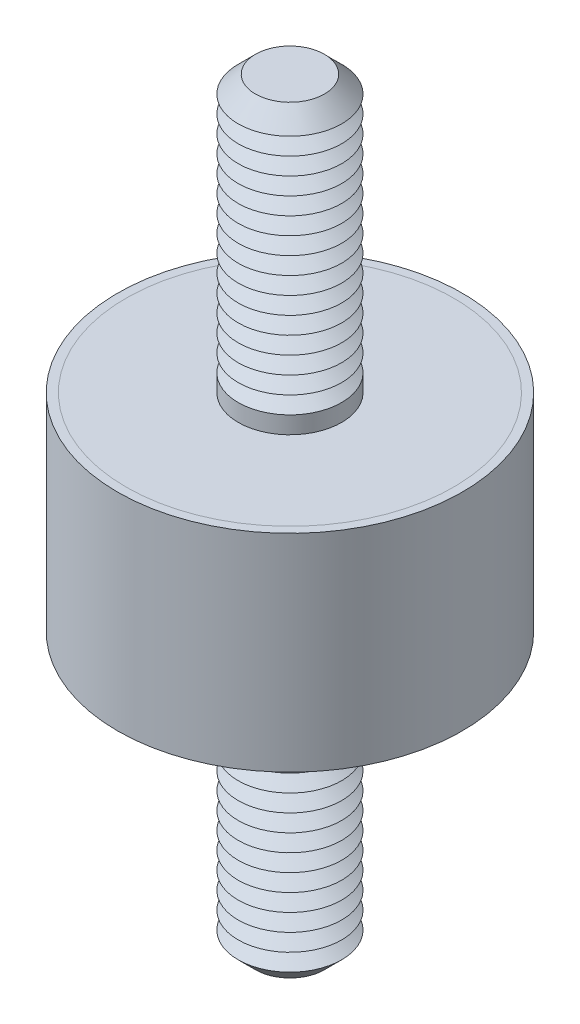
ISO-10303-21;
HEADER;
FILE_DESCRIPTION(('STEP AP214'),'2;1');
FILE_NAME('part.step','',(''),(''),'','','');
FILE_SCHEMA(('AUTOMOTIVE_DESIGN { 1 0 10303 214 1 1 1 1 }'));
ENDSEC;
DATA;
#1=APPLICATION_CONTEXT('core data for automotive mechanical design processes');
#2=APPLICATION_PROTOCOL_DEFINITION('international standard','automotive_design',2000,#1);
#3=PRODUCT_CONTEXT('',#1,'mechanical');
#4=PRODUCT('Part','Part','',(#3));
#5=PRODUCT_RELATED_PRODUCT_CATEGORY('part','',(#4));
#6=PRODUCT_DEFINITION_FORMATION('','',#4);
#7=PRODUCT_DEFINITION_CONTEXT('part definition',#1,'design');
#8=PRODUCT_DEFINITION('design','',#6,#7);
#9=PRODUCT_DEFINITION_SHAPE('','',#8);
#10=(LENGTH_UNIT() NAMED_UNIT(*) SI_UNIT(.MILLI.,.METRE.));
#11=(NAMED_UNIT(*) PLANE_ANGLE_UNIT() SI_UNIT($,.RADIAN.));
#12=(NAMED_UNIT(*) SI_UNIT($,.STERADIAN.) SOLID_ANGLE_UNIT());
#13=UNCERTAINTY_MEASURE_WITH_UNIT(LENGTH_MEASURE(1.E-05),#10,'distance_accuracy_value','');
#14=(GEOMETRIC_REPRESENTATION_CONTEXT(3) GLOBAL_UNCERTAINTY_ASSIGNED_CONTEXT((#13)) GLOBAL_UNIT_ASSIGNED_CONTEXT((#10,
#11,#12)) REPRESENTATION_CONTEXT('',''));
#15=CARTESIAN_POINT('',(0.,0.,0.));
#16=DIRECTION('',(0.,0.,1.));
#17=DIRECTION('',(1.,0.,0.));
#18=AXIS2_PLACEMENT_3D('',#15,#16,#17);
#19=CARTESIAN_POINT('',(0.,-22.,0.));
#20=DIRECTION('',(0.,1.,0.));
#21=DIRECTION('',(0.,0.,1.));
#22=AXIS2_PLACEMENT_3D('',#19,#20,#21);
#23=CYLINDRICAL_SURFACE('',#22,3.);
#24=CARTESIAN_POINT('',(0.,-6.,0.));
#25=DIRECTION('',(0.,-1.,0.));
#26=DIRECTION('',(0.,0.,-1.));
#27=AXIS2_PLACEMENT_3D('',#24,#25,#26);
#28=CIRCLE('',#27,3.);
#29=CARTESIAN_POINT('',(0.,-6.,-3.));
#30=VERTEX_POINT('',#29);
#31=EDGE_CURVE('P0_E21',#30,#30,#28,.T.);
#32=ORIENTED_EDGE('',*,*,#31,.T.);
#33=EDGE_LOOP('',(#32));
#34=FACE_BOUND('',#33,.T.);
#35=CARTESIAN_POINT('',(0.,-7.,0.));
#36=DIRECTION('',(0.,1.,0.));
#37=DIRECTION('',(0.,0.,1.));
#38=AXIS2_PLACEMENT_3D('',#35,#36,#37);
#39=CIRCLE('',#38,3.);
#40=CARTESIAN_POINT('',(0.,-7.,3.));
#41=VERTEX_POINT('',#40);
#42=EDGE_CURVE('P0_E33',#41,#41,#39,.T.);
#43=ORIENTED_EDGE('',*,*,#42,.T.);
#44=EDGE_LOOP('',(#43));
#45=FACE_BOUND('',#44,.T.);
#46=ADVANCED_FACE('P0_F14',(#34,#45),#23,.T.);
#47=CARTESIAN_POINT('',(0.,-6.,0.));
#48=DIRECTION('',(0.,1.,0.));
#49=DIRECTION('',(0.,0.,1.));
#50=AXIS2_PLACEMENT_3D('',#47,#48,#49);
#51=CYLINDRICAL_SURFACE('',#50,9.5);
#52=CARTESIAN_POINT('',(0.,-6.,0.));
#53=DIRECTION('',(0.,1.,0.));
#54=DIRECTION('',(0.,0.,1.));
#55=AXIS2_PLACEMENT_3D('',#52,#53,#54);
#56=CIRCLE('',#55,9.5);
#57=CARTESIAN_POINT('',(0.,-6.,9.5));
#58=VERTEX_POINT('',#57);
#59=EDGE_CURVE('P0_E25',#58,#58,#56,.T.);
#60=ORIENTED_EDGE('',*,*,#59,.T.);
#61=EDGE_LOOP('',(#60));
#62=FACE_BOUND('',#61,.T.);
#63=CARTESIAN_POINT('',(0.,-5.5,0.));
#64=DIRECTION('',(0.,1.,0.));
#65=DIRECTION('',(0.,0.,1.));
#66=AXIS2_PLACEMENT_3D('',#63,#64,#65);
#67=CIRCLE('',#66,9.5);
#68=CARTESIAN_POINT('',(0.,-5.5,9.5));
#69=VERTEX_POINT('',#68);
#70=EDGE_CURVE('P0_E30',#69,#69,#67,.T.);
#71=ORIENTED_EDGE('',*,*,#70,.F.);
#72=EDGE_LOOP('',(#71));
#73=FACE_BOUND('',#72,.T.);
#74=ADVANCED_FACE('P0_F145',(#62,#73),#51,.T.);
#75=CARTESIAN_POINT('',(0.,-6.,0.));
#76=DIRECTION('',(0.,1.,0.));
#77=DIRECTION('',(0.,0.,1.));
#78=AXIS2_PLACEMENT_3D('',#75,#76,#77);
#79=PLANE('',#78);
#80=ORIENTED_EDGE('',*,*,#31,.F.);
#81=EDGE_LOOP('',(#80));
#82=FACE_BOUND('',#81,.T.);
#83=ORIENTED_EDGE('',*,*,#59,.F.);
#84=EDGE_LOOP('',(#83));
#85=FACE_BOUND('',#84,.T.);
#86=ADVANCED_FACE('P0_F150',(#82,#85),#79,.F.);
#87=CARTESIAN_POINT('',(0.,-5.5,0.));
#88=DIRECTION('',(0.,1.,0.));
#89=DIRECTION('',(0.,0.,1.));
#90=AXIS2_PLACEMENT_3D('',#87,#88,#89);
#91=PLANE('',#90);
#92=ORIENTED_EDGE('',*,*,#70,.T.);
#93=EDGE_LOOP('',(#92));
#94=FACE_BOUND('',#93,.T.);
#95=ADVANCED_FACE('P0_F156',(#94),#91,.T.);
#96=CARTESIAN_POINT('',(0.,-7.,0.));
#97=DIRECTION('',(0.,1.,0.));
#98=DIRECTION('',(0.,0.,1.));
#99=AXIS2_PLACEMENT_3D('',#96,#97,#98);
#100=CONICAL_SURFACE('',#99,3.,1.0471975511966);
#101=CARTESIAN_POINT('',(0.,-7.5,0.));
#102=DIRECTION('',(0.,1.,0.));
#103=DIRECTION('',(0.,0.,1.));
#104=AXIS2_PLACEMENT_3D('',#101,#102,#103);
#105=CIRCLE('',#104,2.13397459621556);
#106=CARTESIAN_POINT('',(0.,-7.5,2.13397459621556));
#107=VERTEX_POINT('',#106);
#108=EDGE_CURVE('P0_E39',#107,#107,#105,.T.);
#109=ORIENTED_EDGE('',*,*,#108,.T.);
#110=EDGE_LOOP('',(#109));
#111=FACE_BOUND('',#110,.T.);
#112=ORIENTED_EDGE('',*,*,#42,.F.);
#113=EDGE_LOOP('',(#112));
#114=FACE_BOUND('',#113,.T.);
#115=ADVANCED_FACE('P0_F159',(#111,#114),#100,.T.);
#116=CARTESIAN_POINT('',(0.,-7.5,0.));
#117=DIRECTION('',(0.,-1.,0.));
#118=DIRECTION('',(0.,0.,-1.));
#119=AXIS2_PLACEMENT_3D('',#116,#117,#118);
#120=CONICAL_SURFACE('',#119,2.13397459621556,1.0471975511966);
#121=CARTESIAN_POINT('',(0.,-8.,0.));
#122=DIRECTION('',(0.,1.,0.));
#123=DIRECTION('',(0.,0.,1.));
#124=AXIS2_PLACEMENT_3D('',#121,#122,#123);
#125=CIRCLE('',#124,3.);
#126=CARTESIAN_POINT('',(0.,-8.,3.));
#127=VERTEX_POINT('',#126);
#128=EDGE_CURVE('P0_E43',#127,#127,#125,.T.);
#129=ORIENTED_EDGE('',*,*,#128,.T.);
#130=EDGE_LOOP('',(#129));
#131=FACE_BOUND('',#130,.T.);
#132=ORIENTED_EDGE('',*,*,#108,.F.);
#133=EDGE_LOOP('',(#132));
#134=FACE_BOUND('',#133,.T.);
#135=ADVANCED_FACE('P0_F163',(#131,#134),#120,.T.);
#136=CARTESIAN_POINT('',(0.,-8.,0.));
#137=DIRECTION('',(0.,1.,0.));
#138=DIRECTION('',(0.,0.,1.));
#139=AXIS2_PLACEMENT_3D('',#136,#137,#138);
#140=CONICAL_SURFACE('',#139,3.,1.0471975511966);
#141=CARTESIAN_POINT('',(0.,-8.5,0.));
#142=DIRECTION('',(0.,1.,0.));
#143=DIRECTION('',(0.,0.,1.));
#144=AXIS2_PLACEMENT_3D('',#141,#142,#143);
#145=CIRCLE('',#144,2.13397459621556);
#146=CARTESIAN_POINT('',(0.,-8.5,2.13397459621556));
#147=VERTEX_POINT('',#146);
#148=EDGE_CURVE('P0_E47',#147,#147,#145,.T.);
#149=ORIENTED_EDGE('',*,*,#148,.T.);
#150=EDGE_LOOP('',(#149));
#151=FACE_BOUND('',#150,.T.);
#152=ORIENTED_EDGE('',*,*,#128,.F.);
#153=EDGE_LOOP('',(#152));
#154=FACE_BOUND('',#153,.T.);
#155=ADVANCED_FACE('P0_F167',(#151,#154),#140,.T.);
#156=CARTESIAN_POINT('',(0.,-8.5,0.));
#157=DIRECTION('',(0.,-1.,0.));
#158=DIRECTION('',(0.,0.,-1.));
#159=AXIS2_PLACEMENT_3D('',#156,#157,#158);
#160=CONICAL_SURFACE('',#159,2.13397459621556,1.0471975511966);
#161=CARTESIAN_POINT('',(0.,-9.,0.));
#162=DIRECTION('',(0.,1.,0.));
#163=DIRECTION('',(0.,0.,1.));
#164=AXIS2_PLACEMENT_3D('',#161,#162,#163);
#165=CIRCLE('',#164,3.);
#166=CARTESIAN_POINT('',(0.,-9.,3.));
#167=VERTEX_POINT('',#166);
#168=EDGE_CURVE('P0_E52',#167,#167,#165,.T.);
#169=ORIENTED_EDGE('',*,*,#168,.T.);
#170=EDGE_LOOP('',(#169));
#171=FACE_BOUND('',#170,.T.);
#172=ORIENTED_EDGE('',*,*,#148,.F.);
#173=EDGE_LOOP('',(#172));
#174=FACE_BOUND('',#173,.T.);
#175=ADVANCED_FACE('P0_F174',(#171,#174),#160,.T.);
#176=CARTESIAN_POINT('',(0.,-9.,0.));
#177=DIRECTION('',(0.,1.,0.));
#178=DIRECTION('',(0.,0.,1.));
#179=AXIS2_PLACEMENT_3D('',#176,#177,#178);
#180=CONICAL_SURFACE('',#179,3.,1.0471975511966);
#181=CARTESIAN_POINT('',(0.,-9.5,0.));
#182=DIRECTION('',(0.,1.,0.));
#183=DIRECTION('',(0.,0.,1.));
#184=AXIS2_PLACEMENT_3D('',#181,#182,#183);
#185=CIRCLE('',#184,2.13397459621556);
#186=CARTESIAN_POINT('',(0.,-9.5,2.13397459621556));
#187=VERTEX_POINT('',#186);
#188=EDGE_CURVE('P0_E55',#187,#187,#185,.T.);
#189=ORIENTED_EDGE('',*,*,#188,.T.);
#190=EDGE_LOOP('',(#189));
#191=FACE_BOUND('',#190,.T.);
#192=ORIENTED_EDGE('',*,*,#168,.F.);
#193=EDGE_LOOP('',(#192));
#194=FACE_BOUND('',#193,.T.);
#195=ADVANCED_FACE('P0_F178',(#191,#194),#180,.T.);
#196=CARTESIAN_POINT('',(0.,-9.5,0.));
#197=DIRECTION('',(0.,-1.,0.));
#198=DIRECTION('',(0.,0.,-1.));
#199=AXIS2_PLACEMENT_3D('',#196,#197,#198);
#200=CONICAL_SURFACE('',#199,2.13397459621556,1.0471975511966);
#201=CARTESIAN_POINT('',(0.,-10.,0.));
#202=DIRECTION('',(0.,1.,0.));
#203=DIRECTION('',(0.,0.,1.));
#204=AXIS2_PLACEMENT_3D('',#201,#202,#203);
#205=CIRCLE('',#204,3.);
#206=CARTESIAN_POINT('',(0.,-10.,3.));
#207=VERTEX_POINT('',#206);
#208=EDGE_CURVE('P0_E58',#207,#207,#205,.T.);
#209=ORIENTED_EDGE('',*,*,#208,.T.);
#210=EDGE_LOOP('',(#209));
#211=FACE_BOUND('',#210,.T.);
#212=ORIENTED_EDGE('',*,*,#188,.F.);
#213=EDGE_LOOP('',(#212));
#214=FACE_BOUND('',#213,.T.);
#215=ADVANCED_FACE('P0_F182',(#211,#214),#200,.T.);
#216=CARTESIAN_POINT('',(0.,-10.,0.));
#217=DIRECTION('',(0.,1.,0.));
#218=DIRECTION('',(0.,0.,1.));
#219=AXIS2_PLACEMENT_3D('',#216,#217,#218);
#220=CONICAL_SURFACE('',#219,3.,1.0471975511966);
#221=CARTESIAN_POINT('',(0.,-10.5,0.));
#222=DIRECTION('',(0.,1.,0.));
#223=DIRECTION('',(0.,0.,1.));
#224=AXIS2_PLACEMENT_3D('',#221,#222,#223);
#225=CIRCLE('',#224,2.13397459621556);
#226=CARTESIAN_POINT('',(0.,-10.5,2.13397459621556));
#227=VERTEX_POINT('',#226);
#228=EDGE_CURVE('P0_E61',#227,#227,#225,.T.);
#229=ORIENTED_EDGE('',*,*,#228,.T.);
#230=EDGE_LOOP('',(#229));
#231=FACE_BOUND('',#230,.T.);
#232=ORIENTED_EDGE('',*,*,#208,.F.);
#233=EDGE_LOOP('',(#232));
#234=FACE_BOUND('',#233,.T.);
#235=ADVANCED_FACE('P0_F186',(#231,#234),#220,.T.);
#236=CARTESIAN_POINT('',(0.,-10.5,0.));
#237=DIRECTION('',(0.,-1.,0.));
#238=DIRECTION('',(0.,0.,-1.));
#239=AXIS2_PLACEMENT_3D('',#236,#237,#238);
#240=CONICAL_SURFACE('',#239,2.13397459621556,1.0471975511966);
#241=CARTESIAN_POINT('',(0.,-11.,0.));
#242=DIRECTION('',(0.,1.,0.));
#243=DIRECTION('',(0.,0.,1.));
#244=AXIS2_PLACEMENT_3D('',#241,#242,#243);
#245=CIRCLE('',#244,3.);
#246=CARTESIAN_POINT('',(0.,-11.,3.));
#247=VERTEX_POINT('',#246);
#248=EDGE_CURVE('P0_E64',#247,#247,#245,.T.);
#249=ORIENTED_EDGE('',*,*,#248,.T.);
#250=EDGE_LOOP('',(#249));
#251=FACE_BOUND('',#250,.T.);
#252=ORIENTED_EDGE('',*,*,#228,.F.);
#253=EDGE_LOOP('',(#252));
#254=FACE_BOUND('',#253,.T.);
#255=ADVANCED_FACE('P0_F190',(#251,#254),#240,.T.);
#256=CARTESIAN_POINT('',(0.,-11.,0.));
#257=DIRECTION('',(0.,1.,0.));
#258=DIRECTION('',(0.,0.,1.));
#259=AXIS2_PLACEMENT_3D('',#256,#257,#258);
#260=CONICAL_SURFACE('',#259,3.,1.0471975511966);
#261=CARTESIAN_POINT('',(0.,-11.5,0.));
#262=DIRECTION('',(0.,1.,0.));
#263=DIRECTION('',(0.,0.,1.));
#264=AXIS2_PLACEMENT_3D('',#261,#262,#263);
#265=CIRCLE('',#264,2.13397459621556);
#266=CARTESIAN_POINT('',(0.,-11.5,2.13397459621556));
#267=VERTEX_POINT('',#266);
#268=EDGE_CURVE('P0_E67',#267,#267,#265,.T.);
#269=ORIENTED_EDGE('',*,*,#268,.T.);
#270=EDGE_LOOP('',(#269));
#271=FACE_BOUND('',#270,.T.);
#272=ORIENTED_EDGE('',*,*,#248,.F.);
#273=EDGE_LOOP('',(#272));
#274=FACE_BOUND('',#273,.T.);
#275=ADVANCED_FACE('P0_F194',(#271,#274),#260,.T.);
#276=CARTESIAN_POINT('',(0.,-11.5,0.));
#277=DIRECTION('',(0.,-1.,0.));
#278=DIRECTION('',(0.,0.,-1.));
#279=AXIS2_PLACEMENT_3D('',#276,#277,#278);
#280=CONICAL_SURFACE('',#279,2.13397459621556,1.0471975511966);
#281=CARTESIAN_POINT('',(0.,-12.,0.));
#282=DIRECTION('',(0.,1.,0.));
#283=DIRECTION('',(0.,0.,1.));
#284=AXIS2_PLACEMENT_3D('',#281,#282,#283);
#285=CIRCLE('',#284,3.);
#286=CARTESIAN_POINT('',(0.,-12.,3.));
#287=VERTEX_POINT('',#286);
#288=EDGE_CURVE('P0_E70',#287,#287,#285,.T.);
#289=ORIENTED_EDGE('',*,*,#288,.T.);
#290=EDGE_LOOP('',(#289));
#291=FACE_BOUND('',#290,.T.);
#292=ORIENTED_EDGE('',*,*,#268,.F.);
#293=EDGE_LOOP('',(#292));
#294=FACE_BOUND('',#293,.T.);
#295=ADVANCED_FACE('P0_F198',(#291,#294),#280,.T.);
#296=CARTESIAN_POINT('',(0.,-12.,0.));
#297=DIRECTION('',(0.,1.,0.));
#298=DIRECTION('',(0.,0.,1.));
#299=AXIS2_PLACEMENT_3D('',#296,#297,#298);
#300=CONICAL_SURFACE('',#299,3.,1.0471975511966);
#301=CARTESIAN_POINT('',(0.,-12.5,0.));
#302=DIRECTION('',(0.,1.,0.));
#303=DIRECTION('',(0.,0.,1.));
#304=AXIS2_PLACEMENT_3D('',#301,#302,#303);
#305=CIRCLE('',#304,2.13397459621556);
#306=CARTESIAN_POINT('',(0.,-12.5,2.13397459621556));
#307=VERTEX_POINT('',#306);
#308=EDGE_CURVE('P0_E73',#307,#307,#305,.T.);
#309=ORIENTED_EDGE('',*,*,#308,.T.);
#310=EDGE_LOOP('',(#309));
#311=FACE_BOUND('',#310,.T.);
#312=ORIENTED_EDGE('',*,*,#288,.F.);
#313=EDGE_LOOP('',(#312));
#314=FACE_BOUND('',#313,.T.);
#315=ADVANCED_FACE('P0_F202',(#311,#314),#300,.T.);
#316=CARTESIAN_POINT('',(0.,-12.5,0.));
#317=DIRECTION('',(0.,-1.,0.));
#318=DIRECTION('',(0.,0.,-1.));
#319=AXIS2_PLACEMENT_3D('',#316,#317,#318);
#320=CONICAL_SURFACE('',#319,2.13397459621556,1.0471975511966);
#321=CARTESIAN_POINT('',(0.,-13.,0.));
#322=DIRECTION('',(0.,1.,0.));
#323=DIRECTION('',(0.,0.,1.));
#324=AXIS2_PLACEMENT_3D('',#321,#322,#323);
#325=CIRCLE('',#324,3.);
#326=CARTESIAN_POINT('',(0.,-13.,3.));
#327=VERTEX_POINT('',#326);
#328=EDGE_CURVE('P0_E76',#327,#327,#325,.T.);
#329=ORIENTED_EDGE('',*,*,#328,.T.);
#330=EDGE_LOOP('',(#329));
#331=FACE_BOUND('',#330,.T.);
#332=ORIENTED_EDGE('',*,*,#308,.F.);
#333=EDGE_LOOP('',(#332));
#334=FACE_BOUND('',#333,.T.);
#335=ADVANCED_FACE('P0_F206',(#331,#334),#320,.T.);
#336=CARTESIAN_POINT('',(0.,-13.,0.));
#337=DIRECTION('',(0.,1.,0.));
#338=DIRECTION('',(0.,0.,1.));
#339=AXIS2_PLACEMENT_3D('',#336,#337,#338);
#340=CONICAL_SURFACE('',#339,3.,1.0471975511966);
#341=CARTESIAN_POINT('',(0.,-13.5,0.));
#342=DIRECTION('',(0.,1.,0.));
#343=DIRECTION('',(0.,0.,1.));
#344=AXIS2_PLACEMENT_3D('',#341,#342,#343);
#345=CIRCLE('',#344,2.13397459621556);
#346=CARTESIAN_POINT('',(0.,-13.5,2.13397459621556));
#347=VERTEX_POINT('',#346);
#348=EDGE_CURVE('P0_E79',#347,#347,#345,.T.);
#349=ORIENTED_EDGE('',*,*,#348,.T.);
#350=EDGE_LOOP('',(#349));
#351=FACE_BOUND('',#350,.T.);
#352=ORIENTED_EDGE('',*,*,#328,.F.);
#353=EDGE_LOOP('',(#352));
#354=FACE_BOUND('',#353,.T.);
#355=ADVANCED_FACE('P0_F210',(#351,#354),#340,.T.);
#356=CARTESIAN_POINT('',(0.,-13.5,0.));
#357=DIRECTION('',(0.,-1.,0.));
#358=DIRECTION('',(0.,0.,-1.));
#359=AXIS2_PLACEMENT_3D('',#356,#357,#358);
#360=CONICAL_SURFACE('',#359,2.13397459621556,1.0471975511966);
#361=CARTESIAN_POINT('',(0.,-14.,0.));
#362=DIRECTION('',(0.,1.,0.));
#363=DIRECTION('',(0.,0.,1.));
#364=AXIS2_PLACEMENT_3D('',#361,#362,#363);
#365=CIRCLE('',#364,3.);
#366=CARTESIAN_POINT('',(0.,-14.,3.));
#367=VERTEX_POINT('',#366);
#368=EDGE_CURVE('P0_E82',#367,#367,#365,.T.);
#369=ORIENTED_EDGE('',*,*,#368,.T.);
#370=EDGE_LOOP('',(#369));
#371=FACE_BOUND('',#370,.T.);
#372=ORIENTED_EDGE('',*,*,#348,.F.);
#373=EDGE_LOOP('',(#372));
#374=FACE_BOUND('',#373,.T.);
#375=ADVANCED_FACE('P0_F214',(#371,#374),#360,.T.);
#376=CARTESIAN_POINT('',(0.,-14.,0.));
#377=DIRECTION('',(0.,1.,0.));
#378=DIRECTION('',(0.,0.,1.));
#379=AXIS2_PLACEMENT_3D('',#376,#377,#378);
#380=CONICAL_SURFACE('',#379,3.,1.0471975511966);
#381=CARTESIAN_POINT('',(0.,-14.5,0.));
#382=DIRECTION('',(0.,1.,0.));
#383=DIRECTION('',(0.,0.,1.));
#384=AXIS2_PLACEMENT_3D('',#381,#382,#383);
#385=CIRCLE('',#384,2.13397459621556);
#386=CARTESIAN_POINT('',(0.,-14.5,2.13397459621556));
#387=VERTEX_POINT('',#386);
#388=EDGE_CURVE('P0_E85',#387,#387,#385,.T.);
#389=ORIENTED_EDGE('',*,*,#388,.T.);
#390=EDGE_LOOP('',(#389));
#391=FACE_BOUND('',#390,.T.);
#392=ORIENTED_EDGE('',*,*,#368,.F.);
#393=EDGE_LOOP('',(#392));
#394=FACE_BOUND('',#393,.T.);
#395=ADVANCED_FACE('P0_F218',(#391,#394),#380,.T.);
#396=CARTESIAN_POINT('',(0.,-14.5,0.));
#397=DIRECTION('',(0.,-1.,0.));
#398=DIRECTION('',(0.,0.,-1.));
#399=AXIS2_PLACEMENT_3D('',#396,#397,#398);
#400=CONICAL_SURFACE('',#399,2.13397459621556,1.0471975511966);
#401=CARTESIAN_POINT('',(0.,-15.,0.));
#402=DIRECTION('',(0.,1.,0.));
#403=DIRECTION('',(0.,0.,1.));
#404=AXIS2_PLACEMENT_3D('',#401,#402,#403);
#405=CIRCLE('',#404,3.);
#406=CARTESIAN_POINT('',(0.,-15.,3.));
#407=VERTEX_POINT('',#406);
#408=EDGE_CURVE('P0_E88',#407,#407,#405,.T.);
#409=ORIENTED_EDGE('',*,*,#408,.T.);
#410=EDGE_LOOP('',(#409));
#411=FACE_BOUND('',#410,.T.);
#412=ORIENTED_EDGE('',*,*,#388,.F.);
#413=EDGE_LOOP('',(#412));
#414=FACE_BOUND('',#413,.T.);
#415=ADVANCED_FACE('P0_F222',(#411,#414),#400,.T.);
#416=CARTESIAN_POINT('',(0.,-15.,0.));
#417=DIRECTION('',(0.,1.,0.));
#418=DIRECTION('',(0.,0.,1.));
#419=AXIS2_PLACEMENT_3D('',#416,#417,#418);
#420=CONICAL_SURFACE('',#419,3.,1.0471975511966);
#421=CARTESIAN_POINT('',(0.,-15.5,0.));
#422=DIRECTION('',(0.,1.,0.));
#423=DIRECTION('',(0.,0.,1.));
#424=AXIS2_PLACEMENT_3D('',#421,#422,#423);
#425=CIRCLE('',#424,2.13397459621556);
#426=CARTESIAN_POINT('',(0.,-15.5,2.13397459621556));
#427=VERTEX_POINT('',#426);
#428=EDGE_CURVE('P0_E91',#427,#427,#425,.T.);
#429=ORIENTED_EDGE('',*,*,#428,.T.);
#430=EDGE_LOOP('',(#429));
#431=FACE_BOUND('',#430,.T.);
#432=ORIENTED_EDGE('',*,*,#408,.F.);
#433=EDGE_LOOP('',(#432));
#434=FACE_BOUND('',#433,.T.);
#435=ADVANCED_FACE('P0_F226',(#431,#434),#420,.T.);
#436=CARTESIAN_POINT('',(0.,-15.5,0.));
#437=DIRECTION('',(0.,-1.,0.));
#438=DIRECTION('',(0.,0.,-1.));
#439=AXIS2_PLACEMENT_3D('',#436,#437,#438);
#440=CONICAL_SURFACE('',#439,2.13397459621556,1.0471975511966);
#441=CARTESIAN_POINT('',(0.,-16.,0.));
#442=DIRECTION('',(0.,1.,0.));
#443=DIRECTION('',(0.,0.,1.));
#444=AXIS2_PLACEMENT_3D('',#441,#442,#443);
#445=CIRCLE('',#444,3.);
#446=CARTESIAN_POINT('',(0.,-16.,3.));
#447=VERTEX_POINT('',#446);
#448=EDGE_CURVE('P0_E94',#447,#447,#445,.T.);
#449=ORIENTED_EDGE('',*,*,#448,.T.);
#450=EDGE_LOOP('',(#449));
#451=FACE_BOUND('',#450,.T.);
#452=ORIENTED_EDGE('',*,*,#428,.F.);
#453=EDGE_LOOP('',(#452));
#454=FACE_BOUND('',#453,.T.);
#455=ADVANCED_FACE('P0_F230',(#451,#454),#440,.T.);
#456=CARTESIAN_POINT('',(0.,-16.,0.));
#457=DIRECTION('',(0.,1.,0.));
#458=DIRECTION('',(0.,0.,1.));
#459=AXIS2_PLACEMENT_3D('',#456,#457,#458);
#460=CONICAL_SURFACE('',#459,3.,1.0471975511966);
#461=CARTESIAN_POINT('',(0.,-16.5,0.));
#462=DIRECTION('',(0.,1.,0.));
#463=DIRECTION('',(0.,0.,1.));
#464=AXIS2_PLACEMENT_3D('',#461,#462,#463);
#465=CIRCLE('',#464,2.13397459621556);
#466=CARTESIAN_POINT('',(0.,-16.5,2.13397459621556));
#467=VERTEX_POINT('',#466);
#468=EDGE_CURVE('P0_E97',#467,#467,#465,.T.);
#469=ORIENTED_EDGE('',*,*,#468,.T.);
#470=EDGE_LOOP('',(#469));
#471=FACE_BOUND('',#470,.T.);
#472=ORIENTED_EDGE('',*,*,#448,.F.);
#473=EDGE_LOOP('',(#472));
#474=FACE_BOUND('',#473,.T.);
#475=ADVANCED_FACE('P0_F234',(#471,#474),#460,.T.);
#476=CARTESIAN_POINT('',(0.,-16.5,0.));
#477=DIRECTION('',(0.,-1.,0.));
#478=DIRECTION('',(0.,0.,-1.));
#479=AXIS2_PLACEMENT_3D('',#476,#477,#478);
#480=CONICAL_SURFACE('',#479,2.13397459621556,1.0471975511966);
#481=CARTESIAN_POINT('',(0.,-17.,0.));
#482=DIRECTION('',(0.,1.,0.));
#483=DIRECTION('',(0.,0.,1.));
#484=AXIS2_PLACEMENT_3D('',#481,#482,#483);
#485=CIRCLE('',#484,3.);
#486=CARTESIAN_POINT('',(0.,-17.,3.));
#487=VERTEX_POINT('',#486);
#488=EDGE_CURVE('P0_E100',#487,#487,#485,.T.);
#489=ORIENTED_EDGE('',*,*,#488,.T.);
#490=EDGE_LOOP('',(#489));
#491=FACE_BOUND('',#490,.T.);
#492=ORIENTED_EDGE('',*,*,#468,.F.);
#493=EDGE_LOOP('',(#492));
#494=FACE_BOUND('',#493,.T.);
#495=ADVANCED_FACE('P0_F238',(#491,#494),#480,.T.);
#496=CARTESIAN_POINT('',(0.,-17.,0.));
#497=DIRECTION('',(0.,1.,0.));
#498=DIRECTION('',(0.,0.,1.));
#499=AXIS2_PLACEMENT_3D('',#496,#497,#498);
#500=CONICAL_SURFACE('',#499,3.,1.0471975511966);
#501=CARTESIAN_POINT('',(0.,-17.5,0.));
#502=DIRECTION('',(0.,1.,0.));
#503=DIRECTION('',(0.,0.,1.));
#504=AXIS2_PLACEMENT_3D('',#501,#502,#503);
#505=CIRCLE('',#504,2.13397459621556);
#506=CARTESIAN_POINT('',(0.,-17.5,2.13397459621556));
#507=VERTEX_POINT('',#506);
#508=EDGE_CURVE('P0_E103',#507,#507,#505,.T.);
#509=ORIENTED_EDGE('',*,*,#508,.T.);
#510=EDGE_LOOP('',(#509));
#511=FACE_BOUND('',#510,.T.);
#512=ORIENTED_EDGE('',*,*,#488,.F.);
#513=EDGE_LOOP('',(#512));
#514=FACE_BOUND('',#513,.T.);
#515=ADVANCED_FACE('P0_F242',(#511,#514),#500,.T.);
#516=CARTESIAN_POINT('',(0.,-17.5,0.));
#517=DIRECTION('',(0.,-1.,0.));
#518=DIRECTION('',(0.,0.,-1.));
#519=AXIS2_PLACEMENT_3D('',#516,#517,#518);
#520=CONICAL_SURFACE('',#519,2.13397459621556,1.0471975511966);
#521=CARTESIAN_POINT('',(0.,-18.,0.));
#522=DIRECTION('',(0.,1.,0.));
#523=DIRECTION('',(0.,0.,1.));
#524=AXIS2_PLACEMENT_3D('',#521,#522,#523);
#525=CIRCLE('',#524,3.);
#526=CARTESIAN_POINT('',(0.,-18.,3.));
#527=VERTEX_POINT('',#526);
#528=EDGE_CURVE('P0_E106',#527,#527,#525,.T.);
#529=ORIENTED_EDGE('',*,*,#528,.T.);
#530=EDGE_LOOP('',(#529));
#531=FACE_BOUND('',#530,.T.);
#532=ORIENTED_EDGE('',*,*,#508,.F.);
#533=EDGE_LOOP('',(#532));
#534=FACE_BOUND('',#533,.T.);
#535=ADVANCED_FACE('P0_F246',(#531,#534),#520,.T.);
#536=CARTESIAN_POINT('',(0.,-18.,0.));
#537=DIRECTION('',(0.,1.,0.));
#538=DIRECTION('',(0.,0.,1.));
#539=AXIS2_PLACEMENT_3D('',#536,#537,#538);
#540=CONICAL_SURFACE('',#539,3.,1.0471975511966);
#541=CARTESIAN_POINT('',(0.,-18.5,0.));
#542=DIRECTION('',(0.,1.,0.));
#543=DIRECTION('',(0.,0.,1.));
#544=AXIS2_PLACEMENT_3D('',#541,#542,#543);
#545=CIRCLE('',#544,2.13397459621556);
#546=CARTESIAN_POINT('',(0.,-18.5,2.13397459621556));
#547=VERTEX_POINT('',#546);
#548=EDGE_CURVE('P0_E109',#547,#547,#545,.T.);
#549=ORIENTED_EDGE('',*,*,#548,.T.);
#550=EDGE_LOOP('',(#549));
#551=FACE_BOUND('',#550,.T.);
#552=ORIENTED_EDGE('',*,*,#528,.F.);
#553=EDGE_LOOP('',(#552));
#554=FACE_BOUND('',#553,.T.);
#555=ADVANCED_FACE('P0_F250',(#551,#554),#540,.T.);
#556=CARTESIAN_POINT('',(0.,-18.5,0.));
#557=DIRECTION('',(0.,-1.,0.));
#558=DIRECTION('',(0.,0.,-1.));
#559=AXIS2_PLACEMENT_3D('',#556,#557,#558);
#560=CONICAL_SURFACE('',#559,2.13397459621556,1.0471975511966);
#561=CARTESIAN_POINT('',(0.,-19.,0.));
#562=DIRECTION('',(0.,1.,0.));
#563=DIRECTION('',(0.,0.,1.));
#564=AXIS2_PLACEMENT_3D('',#561,#562,#563);
#565=CIRCLE('',#564,3.);
#566=CARTESIAN_POINT('',(0.,-19.,3.));
#567=VERTEX_POINT('',#566);
#568=EDGE_CURVE('P0_E112',#567,#567,#565,.T.);
#569=ORIENTED_EDGE('',*,*,#568,.T.);
#570=EDGE_LOOP('',(#569));
#571=FACE_BOUND('',#570,.T.);
#572=ORIENTED_EDGE('',*,*,#548,.F.);
#573=EDGE_LOOP('',(#572));
#574=FACE_BOUND('',#573,.T.);
#575=ADVANCED_FACE('P0_F254',(#571,#574),#560,.T.);
#576=CARTESIAN_POINT('',(0.,-19.,0.));
#577=DIRECTION('',(0.,1.,0.));
#578=DIRECTION('',(0.,0.,1.));
#579=AXIS2_PLACEMENT_3D('',#576,#577,#578);
#580=CONICAL_SURFACE('',#579,3.,1.0471975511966);
#581=CARTESIAN_POINT('',(0.,-19.5,0.));
#582=DIRECTION('',(0.,1.,0.));
#583=DIRECTION('',(0.,0.,1.));
#584=AXIS2_PLACEMENT_3D('',#581,#582,#583);
#585=CIRCLE('',#584,2.13397459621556);
#586=CARTESIAN_POINT('',(0.,-19.5,2.13397459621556));
#587=VERTEX_POINT('',#586);
#588=EDGE_CURVE('P0_E115',#587,#587,#585,.T.);
#589=ORIENTED_EDGE('',*,*,#588,.T.);
#590=EDGE_LOOP('',(#589));
#591=FACE_BOUND('',#590,.T.);
#592=ORIENTED_EDGE('',*,*,#568,.F.);
#593=EDGE_LOOP('',(#592));
#594=FACE_BOUND('',#593,.T.);
#595=ADVANCED_FACE('P0_F258',(#591,#594),#580,.T.);
#596=CARTESIAN_POINT('',(0.,-19.5,0.));
#597=DIRECTION('',(0.,-1.,0.));
#598=DIRECTION('',(0.,0.,-1.));
#599=AXIS2_PLACEMENT_3D('',#596,#597,#598);
#600=CONICAL_SURFACE('',#599,2.13397459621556,1.0471975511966);
#601=CARTESIAN_POINT('',(0.,-20.,0.));
#602=DIRECTION('',(0.,1.,0.));
#603=DIRECTION('',(0.,0.,1.));
#604=AXIS2_PLACEMENT_3D('',#601,#602,#603);
#605=CIRCLE('',#604,3.);
#606=CARTESIAN_POINT('',(0.,-20.,3.));
#607=VERTEX_POINT('',#606);
#608=EDGE_CURVE('P0_E118',#607,#607,#605,.T.);
#609=ORIENTED_EDGE('',*,*,#608,.T.);
#610=EDGE_LOOP('',(#609));
#611=FACE_BOUND('',#610,.T.);
#612=ORIENTED_EDGE('',*,*,#588,.F.);
#613=EDGE_LOOP('',(#612));
#614=FACE_BOUND('',#613,.T.);
#615=ADVANCED_FACE('P0_F142',(#611,#614),#600,.T.);
#616=CARTESIAN_POINT('',(0.,-20.,0.));
#617=DIRECTION('',(0.,1.,0.));
#618=DIRECTION('',(0.,0.,1.));
#619=AXIS2_PLACEMENT_3D('',#616,#617,#618);
#620=CONICAL_SURFACE('',#619,3.,1.0471975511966);
#621=CARTESIAN_POINT('',(0.,-20.5,0.));
#622=DIRECTION('',(0.,1.,0.));
#623=DIRECTION('',(0.,0.,1.));
#624=AXIS2_PLACEMENT_3D('',#621,#622,#623);
#625=CIRCLE('',#624,2.13397459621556);
#626=CARTESIAN_POINT('',(0.,-20.5,2.13397459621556));
#627=VERTEX_POINT('',#626);
#628=EDGE_CURVE('P0_E124',#627,#627,#625,.T.);
#629=ORIENTED_EDGE('',*,*,#628,.T.);
#630=EDGE_LOOP('',(#629));
#631=FACE_BOUND('',#630,.T.);
#632=ORIENTED_EDGE('',*,*,#608,.F.);
#633=EDGE_LOOP('',(#632));
#634=FACE_BOUND('',#633,.T.);
#635=ADVANCED_FACE('P0_F128',(#631,#634),#620,.T.);
#636=CARTESIAN_POINT('',(0.,-20.5,0.));
#637=DIRECTION('',(0.,-1.,0.));
#638=DIRECTION('',(0.,0.,-1.));
#639=AXIS2_PLACEMENT_3D('',#636,#637,#638);
#640=CONICAL_SURFACE('',#639,2.13397459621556,1.0471975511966);
#641=CARTESIAN_POINT('',(0.,-21.,0.));
#642=DIRECTION('',(0.,1.,0.));
#643=DIRECTION('',(0.,0.,1.));
#644=AXIS2_PLACEMENT_3D('',#641,#642,#643);
#645=CIRCLE('',#644,3.);
#646=CARTESIAN_POINT('',(0.,-21.,3.));
#647=VERTEX_POINT('',#646);
#648=EDGE_CURVE('P0_E121',#647,#647,#645,.T.);
#649=ORIENTED_EDGE('',*,*,#648,.T.);
#650=EDGE_LOOP('',(#649));
#651=FACE_BOUND('',#650,.T.);
#652=ORIENTED_EDGE('',*,*,#628,.F.);
#653=EDGE_LOOP('',(#652));
#654=FACE_BOUND('',#653,.T.);
#655=ADVANCED_FACE('P0_F131',(#651,#654),#640,.T.);
#656=CARTESIAN_POINT('',(0.,-22.,0.));
#657=DIRECTION('',(0.,-1.,0.));
#658=DIRECTION('',(0.,0.,-1.));
#659=AXIS2_PLACEMENT_3D('',#656,#657,#658);
#660=PLANE('',#659);
#661=CARTESIAN_POINT('',(0.,-22.,0.));
#662=DIRECTION('',(0.,-1.,0.));
#663=DIRECTION('',(0.,0.,-1.));
#664=AXIS2_PLACEMENT_3D('',#661,#662,#663);
#665=CIRCLE('',#664,2.);
#666=CARTESIAN_POINT('',(0.,-22.,-2.));
#667=VERTEX_POINT('',#666);
#668=EDGE_CURVE('P0_E10',#667,#667,#665,.T.);
#669=ORIENTED_EDGE('',*,*,#668,.T.);
#670=EDGE_LOOP('',(#669));
#671=FACE_BOUND('',#670,.T.);
#672=ADVANCED_FACE('P0_F133',(#671),#660,.T.);
#673=CARTESIAN_POINT('',(0.,-22.,0.));
#674=DIRECTION('',(0.,1.,0.));
#675=DIRECTION('',(0.,0.,1.));
#676=AXIS2_PLACEMENT_3D('',#673,#674,#675);
#677=CONICAL_SURFACE('',#676,2.,0.785398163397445);
#678=ORIENTED_EDGE('',*,*,#648,.F.);
#679=EDGE_LOOP('',(#678));
#680=FACE_BOUND('',#679,.T.);
#681=ORIENTED_EDGE('',*,*,#668,.F.);
#682=EDGE_LOOP('',(#681));
#683=FACE_BOUND('',#682,.T.);
#684=ADVANCED_FACE('P0_F16',(#680,#683),#677,.T.);
#685=CLOSED_SHELL('',(#46,#74,#86,#95,#115,#135,#155,#175,#195,#215,#235,#255,#275,#295,#315,
#335,#355,#375,#395,#415,#435,#455,#475,#495,#515,#535,#555,#575,#595,#615,#635,#655,#672,#684));
#686=MANIFOLD_SOLID_BREP('P0_B1',#685);
#687=CARTESIAN_POINT('',(0.,22.,0.));
#688=DIRECTION('',(0.,-1.,0.));
#689=DIRECTION('',(0.,0.,-1.));
#690=AXIS2_PLACEMENT_3D('',#687,#688,#689);
#691=CYLINDRICAL_SURFACE('',#690,3.);
#692=CARTESIAN_POINT('',(0.,7.,0.));
#693=DIRECTION('',(0.,1.,0.));
#694=DIRECTION('',(0.,0.,1.));
#695=AXIS2_PLACEMENT_3D('',#692,#693,#694);
#696=CIRCLE('',#695,3.);
#697=CARTESIAN_POINT('',(0.,7.,3.));
#698=VERTEX_POINT('',#697);
#699=EDGE_CURVE('P1_E33',#698,#698,#696,.T.);
#700=ORIENTED_EDGE('',*,*,#699,.F.);
#701=EDGE_LOOP('',(#700));
#702=FACE_BOUND('',#701,.T.);
#703=CARTESIAN_POINT('',(0.,6.,0.));
#704=DIRECTION('',(0.,1.,0.));
#705=DIRECTION('',(0.,0.,1.));
#706=AXIS2_PLACEMENT_3D('',#703,#704,#705);
#707=CIRCLE('',#706,3.);
#708=CARTESIAN_POINT('',(0.,6.,3.));
#709=VERTEX_POINT('',#708);
#710=EDGE_CURVE('P1_E21',#709,#709,#707,.T.);
#711=ORIENTED_EDGE('',*,*,#710,.T.);
#712=EDGE_LOOP('',(#711));
#713=FACE_BOUND('',#712,.T.);
#714=ADVANCED_FACE('P1_F14',(#702,#713),#691,.T.);
#715=CARTESIAN_POINT('',(0.,6.,0.));
#716=DIRECTION('',(0.,-1.,0.));
#717=DIRECTION('',(0.,0.,-1.));
#718=AXIS2_PLACEMENT_3D('',#715,#716,#717);
#719=CYLINDRICAL_SURFACE('',#718,9.5);
#720=CARTESIAN_POINT('',(0.,6.,0.));
#721=DIRECTION('',(0.,1.,0.));
#722=DIRECTION('',(0.,0.,1.));
#723=AXIS2_PLACEMENT_3D('',#720,#721,#722);
#724=CIRCLE('',#723,9.5);
#725=CARTESIAN_POINT('',(0.,6.,9.5));
#726=VERTEX_POINT('',#725);
#727=EDGE_CURVE('P1_E25',#726,#726,#724,.T.);
#728=ORIENTED_EDGE('',*,*,#727,.F.);
#729=EDGE_LOOP('',(#728));
#730=FACE_BOUND('',#729,.T.);
#731=CARTESIAN_POINT('',(0.,5.5,0.));
#732=DIRECTION('',(0.,1.,0.));
#733=DIRECTION('',(0.,0.,1.));
#734=AXIS2_PLACEMENT_3D('',#731,#732,#733);
#735=CIRCLE('',#734,9.5);
#736=CARTESIAN_POINT('',(0.,5.5,9.5));
#737=VERTEX_POINT('',#736);
#738=EDGE_CURVE('P1_E30',#737,#737,#735,.T.);
#739=ORIENTED_EDGE('',*,*,#738,.T.);
#740=EDGE_LOOP('',(#739));
#741=FACE_BOUND('',#740,.T.);
#742=ADVANCED_FACE('P1_F292',(#730,#741),#719,.T.);
#743=CARTESIAN_POINT('',(0.,6.,0.));
#744=DIRECTION('',(0.,1.,0.));
#745=DIRECTION('',(0.,0.,1.));
#746=AXIS2_PLACEMENT_3D('',#743,#744,#745);
#747=PLANE('',#746);
#748=ORIENTED_EDGE('',*,*,#710,.F.);
#749=EDGE_LOOP('',(#748));
#750=FACE_BOUND('',#749,.T.);
#751=ORIENTED_EDGE('',*,*,#727,.T.);
#752=EDGE_LOOP('',(#751));
#753=FACE_BOUND('',#752,.T.);
#754=ADVANCED_FACE('P1_F298',(#750,#753),#747,.T.);
#755=CARTESIAN_POINT('',(0.,5.5,0.));
#756=DIRECTION('',(0.,1.,0.));
#757=DIRECTION('',(0.,0.,1.));
#758=AXIS2_PLACEMENT_3D('',#755,#756,#757);
#759=PLANE('',#758);
#760=ORIENTED_EDGE('',*,*,#738,.F.);
#761=EDGE_LOOP('',(#760));
#762=FACE_BOUND('',#761,.T.);
#763=ADVANCED_FACE('P1_F288',(#762),#759,.F.);
#764=CARTESIAN_POINT('',(0.,7.,0.));
#765=DIRECTION('',(0.,-1.,0.));
#766=DIRECTION('',(0.,0.,-1.));
#767=AXIS2_PLACEMENT_3D('',#764,#765,#766);
#768=CONICAL_SURFACE('',#767,3.,1.0471975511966);
#769=CARTESIAN_POINT('',(0.,7.5,0.));
#770=DIRECTION('',(0.,1.,0.));
#771=DIRECTION('',(0.,0.,1.));
#772=AXIS2_PLACEMENT_3D('',#769,#770,#771);
#773=CIRCLE('',#772,2.13397459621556);
#774=CARTESIAN_POINT('',(0.,7.5,2.13397459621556));
#775=VERTEX_POINT('',#774);
#776=EDGE_CURVE('P1_E39',#775,#775,#773,.T.);
#777=ORIENTED_EDGE('',*,*,#776,.F.);
#778=EDGE_LOOP('',(#777));
#779=FACE_BOUND('',#778,.T.);
#780=ORIENTED_EDGE('',*,*,#699,.T.);
#781=EDGE_LOOP('',(#780));
#782=FACE_BOUND('',#781,.T.);
#783=ADVANCED_FACE('P1_F282',(#779,#782),#768,.T.);
#784=CARTESIAN_POINT('',(0.,7.5,0.));
#785=DIRECTION('',(0.,1.,0.));
#786=DIRECTION('',(0.,0.,1.));
#787=AXIS2_PLACEMENT_3D('',#784,#785,#786);
#788=CONICAL_SURFACE('',#787,2.13397459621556,1.0471975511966);
#789=CARTESIAN_POINT('',(0.,8.,0.));
#790=DIRECTION('',(0.,1.,0.));
#791=DIRECTION('',(0.,0.,1.));
#792=AXIS2_PLACEMENT_3D('',#789,#790,#791);
#793=CIRCLE('',#792,3.);
#794=CARTESIAN_POINT('',(0.,8.,3.));
#795=VERTEX_POINT('',#794);
#796=EDGE_CURVE('P1_E43',#795,#795,#793,.T.);
#797=ORIENTED_EDGE('',*,*,#796,.F.);
#798=EDGE_LOOP('',(#797));
#799=FACE_BOUND('',#798,.T.);
#800=ORIENTED_EDGE('',*,*,#776,.T.);
#801=EDGE_LOOP('',(#800));
#802=FACE_BOUND('',#801,.T.);
#803=ADVANCED_FACE('P1_F277',(#799,#802),#788,.T.);
#804=CARTESIAN_POINT('',(0.,8.,0.));
#805=DIRECTION('',(0.,-1.,0.));
#806=DIRECTION('',(0.,0.,-1.));
#807=AXIS2_PLACEMENT_3D('',#804,#805,#806);
#808=CONICAL_SURFACE('',#807,3.,1.0471975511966);
#809=CARTESIAN_POINT('',(0.,8.5,0.));
#810=DIRECTION('',(0.,1.,0.));
#811=DIRECTION('',(0.,0.,1.));
#812=AXIS2_PLACEMENT_3D('',#809,#810,#811);
#813=CIRCLE('',#812,2.13397459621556);
#814=CARTESIAN_POINT('',(0.,8.5,2.13397459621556));
#815=VERTEX_POINT('',#814);
#816=EDGE_CURVE('P1_E47',#815,#815,#813,.T.);
#817=ORIENTED_EDGE('',*,*,#816,.F.);
#818=EDGE_LOOP('',(#817));
#819=FACE_BOUND('',#818,.T.);
#820=ORIENTED_EDGE('',*,*,#796,.T.);
#821=EDGE_LOOP('',(#820));
#822=FACE_BOUND('',#821,.T.);
#823=ADVANCED_FACE('P1_F271',(#819,#822),#808,.T.);
#824=CARTESIAN_POINT('',(0.,8.5,0.));
#825=DIRECTION('',(0.,1.,0.));
#826=DIRECTION('',(0.,0.,1.));
#827=AXIS2_PLACEMENT_3D('',#824,#825,#826);
#828=CONICAL_SURFACE('',#827,2.13397459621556,1.0471975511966);
#829=CARTESIAN_POINT('',(0.,9.,0.));
#830=DIRECTION('',(0.,1.,0.));
#831=DIRECTION('',(0.,0.,1.));
#832=AXIS2_PLACEMENT_3D('',#829,#830,#831);
#833=CIRCLE('',#832,3.);
#834=CARTESIAN_POINT('',(0.,9.,3.));
#835=VERTEX_POINT('',#834);
#836=EDGE_CURVE('P1_E52',#835,#835,#833,.T.);
#837=ORIENTED_EDGE('',*,*,#836,.F.);
#838=EDGE_LOOP('',(#837));
#839=FACE_BOUND('',#838,.T.);
#840=ORIENTED_EDGE('',*,*,#816,.T.);
#841=EDGE_LOOP('',(#840));
#842=FACE_BOUND('',#841,.T.);
#843=ADVANCED_FACE('P1_F265',(#839,#842),#828,.T.);
#844=CARTESIAN_POINT('',(0.,9.,0.));
#845=DIRECTION('',(0.,-1.,0.));
#846=DIRECTION('',(0.,0.,-1.));
#847=AXIS2_PLACEMENT_3D('',#844,#845,#846);
#848=CONICAL_SURFACE('',#847,3.,1.0471975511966);
#849=CARTESIAN_POINT('',(0.,9.5,0.));
#850=DIRECTION('',(0.,1.,0.));
#851=DIRECTION('',(0.,0.,1.));
#852=AXIS2_PLACEMENT_3D('',#849,#850,#851);
#853=CIRCLE('',#852,2.13397459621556);
#854=CARTESIAN_POINT('',(0.,9.5,2.13397459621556));
#855=VERTEX_POINT('',#854);
#856=EDGE_CURVE('P1_E55',#855,#855,#853,.T.);
#857=ORIENTED_EDGE('',*,*,#856,.F.);
#858=EDGE_LOOP('',(#857));
#859=FACE_BOUND('',#858,.T.);
#860=ORIENTED_EDGE('',*,*,#836,.T.);
#861=EDGE_LOOP('',(#860));
#862=FACE_BOUND('',#861,.T.);
#863=ADVANCED_FACE('P1_F259',(#859,#862),#848,.T.);
#864=CARTESIAN_POINT('',(0.,9.5,0.));
#865=DIRECTION('',(0.,1.,0.));
#866=DIRECTION('',(0.,0.,1.));
#867=AXIS2_PLACEMENT_3D('',#864,#865,#866);
#868=CONICAL_SURFACE('',#867,2.13397459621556,1.0471975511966);
#869=CARTESIAN_POINT('',(0.,10.,0.));
#870=DIRECTION('',(0.,1.,0.));
#871=DIRECTION('',(0.,0.,1.));
#872=AXIS2_PLACEMENT_3D('',#869,#870,#871);
#873=CIRCLE('',#872,3.);
#874=CARTESIAN_POINT('',(0.,10.,3.));
#875=VERTEX_POINT('',#874);
#876=EDGE_CURVE('P1_E58',#875,#875,#873,.T.);
#877=ORIENTED_EDGE('',*,*,#876,.F.);
#878=EDGE_LOOP('',(#877));
#879=FACE_BOUND('',#878,.T.);
#880=ORIENTED_EDGE('',*,*,#856,.T.);
#881=EDGE_LOOP('',(#880));
#882=FACE_BOUND('',#881,.T.);
#883=ADVANCED_FACE('P1_F253',(#879,#882),#868,.T.);
#884=CARTESIAN_POINT('',(0.,10.,0.));
#885=DIRECTION('',(0.,-1.,0.));
#886=DIRECTION('',(0.,0.,-1.));
#887=AXIS2_PLACEMENT_3D('',#884,#885,#886);
#888=CONICAL_SURFACE('',#887,3.,1.0471975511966);
#889=CARTESIAN_POINT('',(0.,10.5,0.));
#890=DIRECTION('',(0.,1.,0.));
#891=DIRECTION('',(0.,0.,1.));
#892=AXIS2_PLACEMENT_3D('',#889,#890,#891);
#893=CIRCLE('',#892,2.13397459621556);
#894=CARTESIAN_POINT('',(0.,10.5,2.13397459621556));
#895=VERTEX_POINT('',#894);
#896=EDGE_CURVE('P1_E61',#895,#895,#893,.T.);
#897=ORIENTED_EDGE('',*,*,#896,.F.);
#898=EDGE_LOOP('',(#897));
#899=FACE_BOUND('',#898,.T.);
#900=ORIENTED_EDGE('',*,*,#876,.T.);
#901=EDGE_LOOP('',(#900));
#902=FACE_BOUND('',#901,.T.);
#903=ADVANCED_FACE('P1_F247',(#899,#902),#888,.T.);
#904=CARTESIAN_POINT('',(0.,10.5,0.));
#905=DIRECTION('',(0.,1.,0.));
#906=DIRECTION('',(0.,0.,1.));
#907=AXIS2_PLACEMENT_3D('',#904,#905,#906);
#908=CONICAL_SURFACE('',#907,2.13397459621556,1.0471975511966);
#909=CARTESIAN_POINT('',(0.,11.,0.));
#910=DIRECTION('',(0.,1.,0.));
#911=DIRECTION('',(0.,0.,1.));
#912=AXIS2_PLACEMENT_3D('',#909,#910,#911);
#913=CIRCLE('',#912,3.);
#914=CARTESIAN_POINT('',(0.,11.,3.));
#915=VERTEX_POINT('',#914);
#916=EDGE_CURVE('P1_E64',#915,#915,#913,.T.);
#917=ORIENTED_EDGE('',*,*,#916,.F.);
#918=EDGE_LOOP('',(#917));
#919=FACE_BOUND('',#918,.T.);
#920=ORIENTED_EDGE('',*,*,#896,.T.);
#921=EDGE_LOOP('',(#920));
#922=FACE_BOUND('',#921,.T.);
#923=ADVANCED_FACE('P1_F241',(#919,#922),#908,.T.);
#924=CARTESIAN_POINT('',(0.,11.,0.));
#925=DIRECTION('',(0.,-1.,0.));
#926=DIRECTION('',(0.,0.,-1.));
#927=AXIS2_PLACEMENT_3D('',#924,#925,#926);
#928=CONICAL_SURFACE('',#927,3.,1.0471975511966);
#929=CARTESIAN_POINT('',(0.,11.5,0.));
#930=DIRECTION('',(0.,1.,0.));
#931=DIRECTION('',(0.,0.,1.));
#932=AXIS2_PLACEMENT_3D('',#929,#930,#931);
#933=CIRCLE('',#932,2.13397459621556);
#934=CARTESIAN_POINT('',(0.,11.5,2.13397459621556));
#935=VERTEX_POINT('',#934);
#936=EDGE_CURVE('P1_E67',#935,#935,#933,.T.);
#937=ORIENTED_EDGE('',*,*,#936,.F.);
#938=EDGE_LOOP('',(#937));
#939=FACE_BOUND('',#938,.T.);
#940=ORIENTED_EDGE('',*,*,#916,.T.);
#941=EDGE_LOOP('',(#940));
#942=FACE_BOUND('',#941,.T.);
#943=ADVANCED_FACE('P1_F235',(#939,#942),#928,.T.);
#944=CARTESIAN_POINT('',(0.,11.5,0.));
#945=DIRECTION('',(0.,1.,0.));
#946=DIRECTION('',(0.,0.,1.));
#947=AXIS2_PLACEMENT_3D('',#944,#945,#946);
#948=CONICAL_SURFACE('',#947,2.13397459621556,1.0471975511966);
#949=CARTESIAN_POINT('',(0.,12.,0.));
#950=DIRECTION('',(0.,1.,0.));
#951=DIRECTION('',(0.,0.,1.));
#952=AXIS2_PLACEMENT_3D('',#949,#950,#951);
#953=CIRCLE('',#952,3.);
#954=CARTESIAN_POINT('',(0.,12.,3.));
#955=VERTEX_POINT('',#954);
#956=EDGE_CURVE('P1_E70',#955,#955,#953,.T.);
#957=ORIENTED_EDGE('',*,*,#956,.F.);
#958=EDGE_LOOP('',(#957));
#959=FACE_BOUND('',#958,.T.);
#960=ORIENTED_EDGE('',*,*,#936,.T.);
#961=EDGE_LOOP('',(#960));
#962=FACE_BOUND('',#961,.T.);
#963=ADVANCED_FACE('P1_F229',(#959,#962),#948,.T.);
#964=CARTESIAN_POINT('',(0.,12.,0.));
#965=DIRECTION('',(0.,-1.,0.));
#966=DIRECTION('',(0.,0.,-1.));
#967=AXIS2_PLACEMENT_3D('',#964,#965,#966);
#968=CONICAL_SURFACE('',#967,3.,1.0471975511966);
#969=CARTESIAN_POINT('',(0.,12.5,0.));
#970=DIRECTION('',(0.,1.,0.));
#971=DIRECTION('',(0.,0.,1.));
#972=AXIS2_PLACEMENT_3D('',#969,#970,#971);
#973=CIRCLE('',#972,2.13397459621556);
#974=CARTESIAN_POINT('',(0.,12.5,2.13397459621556));
#975=VERTEX_POINT('',#974);
#976=EDGE_CURVE('P1_E73',#975,#975,#973,.T.);
#977=ORIENTED_EDGE('',*,*,#976,.F.);
#978=EDGE_LOOP('',(#977));
#979=FACE_BOUND('',#978,.T.);
#980=ORIENTED_EDGE('',*,*,#956,.T.);
#981=EDGE_LOOP('',(#980));
#982=FACE_BOUND('',#981,.T.);
#983=ADVANCED_FACE('P1_F223',(#979,#982),#968,.T.);
#984=CARTESIAN_POINT('',(0.,12.5,0.));
#985=DIRECTION('',(0.,1.,0.));
#986=DIRECTION('',(0.,0.,1.));
#987=AXIS2_PLACEMENT_3D('',#984,#985,#986);
#988=CONICAL_SURFACE('',#987,2.13397459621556,1.0471975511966);
#989=CARTESIAN_POINT('',(0.,13.,0.));
#990=DIRECTION('',(0.,1.,0.));
#991=DIRECTION('',(0.,0.,1.));
#992=AXIS2_PLACEMENT_3D('',#989,#990,#991);
#993=CIRCLE('',#992,3.);
#994=CARTESIAN_POINT('',(0.,13.,3.));
#995=VERTEX_POINT('',#994);
#996=EDGE_CURVE('P1_E76',#995,#995,#993,.T.);
#997=ORIENTED_EDGE('',*,*,#996,.F.);
#998=EDGE_LOOP('',(#997));
#999=FACE_BOUND('',#998,.T.);
#1000=ORIENTED_EDGE('',*,*,#976,.T.);
#1001=EDGE_LOOP('',(#1000));
#1002=FACE_BOUND('',#1001,.T.);
#1003=ADVANCED_FACE('P1_F217',(#999,#1002),#988,.T.);
#1004=CARTESIAN_POINT('',(0.,13.,0.));
#1005=DIRECTION('',(0.,-1.,0.));
#1006=DIRECTION('',(0.,0.,-1.));
#1007=AXIS2_PLACEMENT_3D('',#1004,#1005,#1006);
#1008=CONICAL_SURFACE('',#1007,3.,1.0471975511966);
#1009=CARTESIAN_POINT('',(0.,13.5,0.));
#1010=DIRECTION('',(0.,1.,0.));
#1011=DIRECTION('',(0.,0.,1.));
#1012=AXIS2_PLACEMENT_3D('',#1009,#1010,#1011);
#1013=CIRCLE('',#1012,2.13397459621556);
#1014=CARTESIAN_POINT('',(0.,13.5,2.13397459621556));
#1015=VERTEX_POINT('',#1014);
#1016=EDGE_CURVE('P1_E79',#1015,#1015,#1013,.T.);
#1017=ORIENTED_EDGE('',*,*,#1016,.F.);
#1018=EDGE_LOOP('',(#1017));
#1019=FACE_BOUND('',#1018,.T.);
#1020=ORIENTED_EDGE('',*,*,#996,.T.);
#1021=EDGE_LOOP('',(#1020));
#1022=FACE_BOUND('',#1021,.T.);
#1023=ADVANCED_FACE('P1_F211',(#1019,#1022),#1008,.T.);
#1024=CARTESIAN_POINT('',(0.,13.5,0.));
#1025=DIRECTION('',(0.,1.,0.));
#1026=DIRECTION('',(0.,0.,1.));
#1027=AXIS2_PLACEMENT_3D('',#1024,#1025,#1026);
#1028=CONICAL_SURFACE('',#1027,2.13397459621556,1.0471975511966);
#1029=CARTESIAN_POINT('',(0.,14.,0.));
#1030=DIRECTION('',(0.,1.,0.));
#1031=DIRECTION('',(0.,0.,1.));
#1032=AXIS2_PLACEMENT_3D('',#1029,#1030,#1031);
#1033=CIRCLE('',#1032,3.);
#1034=CARTESIAN_POINT('',(0.,14.,3.));
#1035=VERTEX_POINT('',#1034);
#1036=EDGE_CURVE('P1_E82',#1035,#1035,#1033,.T.);
#1037=ORIENTED_EDGE('',*,*,#1036,.F.);
#1038=EDGE_LOOP('',(#1037));
#1039=FACE_BOUND('',#1038,.T.);
#1040=ORIENTED_EDGE('',*,*,#1016,.T.);
#1041=EDGE_LOOP('',(#1040));
#1042=FACE_BOUND('',#1041,.T.);
#1043=ADVANCED_FACE('P1_F205',(#1039,#1042),#1028,.T.);
#1044=CARTESIAN_POINT('',(0.,14.,0.));
#1045=DIRECTION('',(0.,-1.,0.));
#1046=DIRECTION('',(0.,0.,-1.));
#1047=AXIS2_PLACEMENT_3D('',#1044,#1045,#1046);
#1048=CONICAL_SURFACE('',#1047,3.,1.0471975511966);
#1049=CARTESIAN_POINT('',(0.,14.5,0.));
#1050=DIRECTION('',(0.,1.,0.));
#1051=DIRECTION('',(0.,0.,1.));
#1052=AXIS2_PLACEMENT_3D('',#1049,#1050,#1051);
#1053=CIRCLE('',#1052,2.13397459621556);
#1054=CARTESIAN_POINT('',(0.,14.5,2.13397459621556));
#1055=VERTEX_POINT('',#1054);
#1056=EDGE_CURVE('P1_E85',#1055,#1055,#1053,.T.);
#1057=ORIENTED_EDGE('',*,*,#1056,.F.);
#1058=EDGE_LOOP('',(#1057));
#1059=FACE_BOUND('',#1058,.T.);
#1060=ORIENTED_EDGE('',*,*,#1036,.T.);
#1061=EDGE_LOOP('',(#1060));
#1062=FACE_BOUND('',#1061,.T.);
#1063=ADVANCED_FACE('P1_F199',(#1059,#1062),#1048,.T.);
#1064=CARTESIAN_POINT('',(0.,14.5,0.));
#1065=DIRECTION('',(0.,1.,0.));
#1066=DIRECTION('',(0.,0.,1.));
#1067=AXIS2_PLACEMENT_3D('',#1064,#1065,#1066);
#1068=CONICAL_SURFACE('',#1067,2.13397459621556,1.0471975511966);
#1069=CARTESIAN_POINT('',(0.,15.,0.));
#1070=DIRECTION('',(0.,1.,0.));
#1071=DIRECTION('',(0.,0.,1.));
#1072=AXIS2_PLACEMENT_3D('',#1069,#1070,#1071);
#1073=CIRCLE('',#1072,3.);
#1074=CARTESIAN_POINT('',(0.,15.,3.));
#1075=VERTEX_POINT('',#1074);
#1076=EDGE_CURVE('P1_E88',#1075,#1075,#1073,.T.);
#1077=ORIENTED_EDGE('',*,*,#1076,.F.);
#1078=EDGE_LOOP('',(#1077));
#1079=FACE_BOUND('',#1078,.T.);
#1080=ORIENTED_EDGE('',*,*,#1056,.T.);
#1081=EDGE_LOOP('',(#1080));
#1082=FACE_BOUND('',#1081,.T.);
#1083=ADVANCED_FACE('P1_F193',(#1079,#1082),#1068,.T.);
#1084=CARTESIAN_POINT('',(0.,15.,0.));
#1085=DIRECTION('',(0.,-1.,0.));
#1086=DIRECTION('',(0.,0.,-1.));
#1087=AXIS2_PLACEMENT_3D('',#1084,#1085,#1086);
#1088=CONICAL_SURFACE('',#1087,3.,1.0471975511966);
#1089=CARTESIAN_POINT('',(0.,15.5,0.));
#1090=DIRECTION('',(0.,1.,0.));
#1091=DIRECTION('',(0.,0.,1.));
#1092=AXIS2_PLACEMENT_3D('',#1089,#1090,#1091);
#1093=CIRCLE('',#1092,2.13397459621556);
#1094=CARTESIAN_POINT('',(0.,15.5,2.13397459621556));
#1095=VERTEX_POINT('',#1094);
#1096=EDGE_CURVE('P1_E91',#1095,#1095,#1093,.T.);
#1097=ORIENTED_EDGE('',*,*,#1096,.F.);
#1098=EDGE_LOOP('',(#1097));
#1099=FACE_BOUND('',#1098,.T.);
#1100=ORIENTED_EDGE('',*,*,#1076,.T.);
#1101=EDGE_LOOP('',(#1100));
#1102=FACE_BOUND('',#1101,.T.);
#1103=ADVANCED_FACE('P1_F187',(#1099,#1102),#1088,.T.);
#1104=CARTESIAN_POINT('',(0.,15.5,0.));
#1105=DIRECTION('',(0.,1.,0.));
#1106=DIRECTION('',(0.,0.,1.));
#1107=AXIS2_PLACEMENT_3D('',#1104,#1105,#1106);
#1108=CONICAL_SURFACE('',#1107,2.13397459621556,1.0471975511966);
#1109=CARTESIAN_POINT('',(0.,16.,0.));
#1110=DIRECTION('',(0.,1.,0.));
#1111=DIRECTION('',(0.,0.,1.));
#1112=AXIS2_PLACEMENT_3D('',#1109,#1110,#1111);
#1113=CIRCLE('',#1112,3.);
#1114=CARTESIAN_POINT('',(0.,16.,3.));
#1115=VERTEX_POINT('',#1114);
#1116=EDGE_CURVE('P1_E94',#1115,#1115,#1113,.T.);
#1117=ORIENTED_EDGE('',*,*,#1116,.F.);
#1118=EDGE_LOOP('',(#1117));
#1119=FACE_BOUND('',#1118,.T.);
#1120=ORIENTED_EDGE('',*,*,#1096,.T.);
#1121=EDGE_LOOP('',(#1120));
#1122=FACE_BOUND('',#1121,.T.);
#1123=ADVANCED_FACE('P1_F181',(#1119,#1122),#1108,.T.);
#1124=CARTESIAN_POINT('',(0.,16.,0.));
#1125=DIRECTION('',(0.,-1.,0.));
#1126=DIRECTION('',(0.,0.,-1.));
#1127=AXIS2_PLACEMENT_3D('',#1124,#1125,#1126);
#1128=CONICAL_SURFACE('',#1127,3.,1.0471975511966);
#1129=CARTESIAN_POINT('',(0.,16.5,0.));
#1130=DIRECTION('',(0.,1.,0.));
#1131=DIRECTION('',(0.,0.,1.));
#1132=AXIS2_PLACEMENT_3D('',#1129,#1130,#1131);
#1133=CIRCLE('',#1132,2.13397459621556);
#1134=CARTESIAN_POINT('',(0.,16.5,2.13397459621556));
#1135=VERTEX_POINT('',#1134);
#1136=EDGE_CURVE('P1_E97',#1135,#1135,#1133,.T.);
#1137=ORIENTED_EDGE('',*,*,#1136,.F.);
#1138=EDGE_LOOP('',(#1137));
#1139=FACE_BOUND('',#1138,.T.);
#1140=ORIENTED_EDGE('',*,*,#1116,.T.);
#1141=EDGE_LOOP('',(#1140));
#1142=FACE_BOUND('',#1141,.T.);
#1143=ADVANCED_FACE('P1_F175',(#1139,#1142),#1128,.T.);
#1144=CARTESIAN_POINT('',(0.,16.5,0.));
#1145=DIRECTION('',(0.,1.,0.));
#1146=DIRECTION('',(0.,0.,1.));
#1147=AXIS2_PLACEMENT_3D('',#1144,#1145,#1146);
#1148=CONICAL_SURFACE('',#1147,2.13397459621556,1.0471975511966);
#1149=CARTESIAN_POINT('',(0.,17.,0.));
#1150=DIRECTION('',(0.,1.,0.));
#1151=DIRECTION('',(0.,0.,1.));
#1152=AXIS2_PLACEMENT_3D('',#1149,#1150,#1151);
#1153=CIRCLE('',#1152,3.);
#1154=CARTESIAN_POINT('',(0.,17.,3.));
#1155=VERTEX_POINT('',#1154);
#1156=EDGE_CURVE('P1_E100',#1155,#1155,#1153,.T.);
#1157=ORIENTED_EDGE('',*,*,#1156,.F.);
#1158=EDGE_LOOP('',(#1157));
#1159=FACE_BOUND('',#1158,.T.);
#1160=ORIENTED_EDGE('',*,*,#1136,.T.);
#1161=EDGE_LOOP('',(#1160));
#1162=FACE_BOUND('',#1161,.T.);
#1163=ADVANCED_FACE('P1_F169',(#1159,#1162),#1148,.T.);
#1164=CARTESIAN_POINT('',(0.,17.,0.));
#1165=DIRECTION('',(0.,-1.,0.));
#1166=DIRECTION('',(0.,0.,-1.));
#1167=AXIS2_PLACEMENT_3D('',#1164,#1165,#1166);
#1168=CONICAL_SURFACE('',#1167,3.,1.0471975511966);
#1169=CARTESIAN_POINT('',(0.,17.5,0.));
#1170=DIRECTION('',(0.,1.,0.));
#1171=DIRECTION('',(0.,0.,1.));
#1172=AXIS2_PLACEMENT_3D('',#1169,#1170,#1171);
#1173=CIRCLE('',#1172,2.13397459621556);
#1174=CARTESIAN_POINT('',(0.,17.5,2.13397459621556));
#1175=VERTEX_POINT('',#1174);
#1176=EDGE_CURVE('P1_E103',#1175,#1175,#1173,.T.);
#1177=ORIENTED_EDGE('',*,*,#1176,.F.);
#1178=EDGE_LOOP('',(#1177));
#1179=FACE_BOUND('',#1178,.T.);
#1180=ORIENTED_EDGE('',*,*,#1156,.T.);
#1181=EDGE_LOOP('',(#1180));
#1182=FACE_BOUND('',#1181,.T.);
#1183=ADVANCED_FACE('P1_F163',(#1179,#1182),#1168,.T.);
#1184=CARTESIAN_POINT('',(0.,17.5,0.));
#1185=DIRECTION('',(0.,1.,0.));
#1186=DIRECTION('',(0.,0.,1.));
#1187=AXIS2_PLACEMENT_3D('',#1184,#1185,#1186);
#1188=CONICAL_SURFACE('',#1187,2.13397459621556,1.0471975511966);
#1189=CARTESIAN_POINT('',(0.,18.,0.));
#1190=DIRECTION('',(0.,1.,0.));
#1191=DIRECTION('',(0.,0.,1.));
#1192=AXIS2_PLACEMENT_3D('',#1189,#1190,#1191);
#1193=CIRCLE('',#1192,3.);
#1194=CARTESIAN_POINT('',(0.,18.,3.));
#1195=VERTEX_POINT('',#1194);
#1196=EDGE_CURVE('P1_E106',#1195,#1195,#1193,.T.);
#1197=ORIENTED_EDGE('',*,*,#1196,.F.);
#1198=EDGE_LOOP('',(#1197));
#1199=FACE_BOUND('',#1198,.T.);
#1200=ORIENTED_EDGE('',*,*,#1176,.T.);
#1201=EDGE_LOOP('',(#1200));
#1202=FACE_BOUND('',#1201,.T.);
#1203=ADVANCED_FACE('P1_F157',(#1199,#1202),#1188,.T.);
#1204=CARTESIAN_POINT('',(0.,18.,0.));
#1205=DIRECTION('',(0.,-1.,0.));
#1206=DIRECTION('',(0.,0.,-1.));
#1207=AXIS2_PLACEMENT_3D('',#1204,#1205,#1206);
#1208=CONICAL_SURFACE('',#1207,3.,1.0471975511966);
#1209=CARTESIAN_POINT('',(0.,18.5,0.));
#1210=DIRECTION('',(0.,1.,0.));
#1211=DIRECTION('',(0.,0.,1.));
#1212=AXIS2_PLACEMENT_3D('',#1209,#1210,#1211);
#1213=CIRCLE('',#1212,2.13397459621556);
#1214=CARTESIAN_POINT('',(0.,18.5,2.13397459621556));
#1215=VERTEX_POINT('',#1214);
#1216=EDGE_CURVE('P1_E109',#1215,#1215,#1213,.T.);
#1217=ORIENTED_EDGE('',*,*,#1216,.F.);
#1218=EDGE_LOOP('',(#1217));
#1219=FACE_BOUND('',#1218,.T.);
#1220=ORIENTED_EDGE('',*,*,#1196,.T.);
#1221=EDGE_LOOP('',(#1220));
#1222=FACE_BOUND('',#1221,.T.);
#1223=ADVANCED_FACE('P1_F151',(#1219,#1222),#1208,.T.);
#1224=CARTESIAN_POINT('',(0.,18.5,0.));
#1225=DIRECTION('',(0.,1.,0.));
#1226=DIRECTION('',(0.,0.,1.));
#1227=AXIS2_PLACEMENT_3D('',#1224,#1225,#1226);
#1228=CONICAL_SURFACE('',#1227,2.13397459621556,1.0471975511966);
#1229=CARTESIAN_POINT('',(0.,19.,0.));
#1230=DIRECTION('',(0.,1.,0.));
#1231=DIRECTION('',(0.,0.,1.));
#1232=AXIS2_PLACEMENT_3D('',#1229,#1230,#1231);
#1233=CIRCLE('',#1232,3.);
#1234=CARTESIAN_POINT('',(0.,19.,3.));
#1235=VERTEX_POINT('',#1234);
#1236=EDGE_CURVE('P1_E112',#1235,#1235,#1233,.T.);
#1237=ORIENTED_EDGE('',*,*,#1236,.F.);
#1238=EDGE_LOOP('',(#1237));
#1239=FACE_BOUND('',#1238,.T.);
#1240=ORIENTED_EDGE('',*,*,#1216,.T.);
#1241=EDGE_LOOP('',(#1240));
#1242=FACE_BOUND('',#1241,.T.);
#1243=ADVANCED_FACE('P1_F145',(#1239,#1242),#1228,.T.);
#1244=CARTESIAN_POINT('',(0.,19.,0.));
#1245=DIRECTION('',(0.,-1.,0.));
#1246=DIRECTION('',(0.,0.,-1.));
#1247=AXIS2_PLACEMENT_3D('',#1244,#1245,#1246);
#1248=CONICAL_SURFACE('',#1247,3.,1.0471975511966);
#1249=CARTESIAN_POINT('',(0.,19.5,0.));
#1250=DIRECTION('',(0.,1.,0.));
#1251=DIRECTION('',(0.,0.,1.));
#1252=AXIS2_PLACEMENT_3D('',#1249,#1250,#1251);
#1253=CIRCLE('',#1252,2.13397459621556);
#1254=CARTESIAN_POINT('',(0.,19.5,2.13397459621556));
#1255=VERTEX_POINT('',#1254);
#1256=EDGE_CURVE('P1_E115',#1255,#1255,#1253,.T.);
#1257=ORIENTED_EDGE('',*,*,#1256,.F.);
#1258=EDGE_LOOP('',(#1257));
#1259=FACE_BOUND('',#1258,.T.);
#1260=ORIENTED_EDGE('',*,*,#1236,.T.);
#1261=EDGE_LOOP('',(#1260));
#1262=FACE_BOUND('',#1261,.T.);
#1263=ADVANCED_FACE('P1_F139',(#1259,#1262),#1248,.T.);
#1264=CARTESIAN_POINT('',(0.,19.5,0.));
#1265=DIRECTION('',(0.,1.,0.));
#1266=DIRECTION('',(0.,0.,1.));
#1267=AXIS2_PLACEMENT_3D('',#1264,#1265,#1266);
#1268=CONICAL_SURFACE('',#1267,2.13397459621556,1.0471975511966);
#1269=CARTESIAN_POINT('',(0.,20.,0.));
#1270=DIRECTION('',(0.,1.,0.));
#1271=DIRECTION('',(0.,0.,1.));
#1272=AXIS2_PLACEMENT_3D('',#1269,#1270,#1271);
#1273=CIRCLE('',#1272,3.);
#1274=CARTESIAN_POINT('',(0.,20.,3.));
#1275=VERTEX_POINT('',#1274);
#1276=EDGE_CURVE('P1_E118',#1275,#1275,#1273,.T.);
#1277=ORIENTED_EDGE('',*,*,#1276,.F.);
#1278=EDGE_LOOP('',(#1277));
#1279=FACE_BOUND('',#1278,.T.);
#1280=ORIENTED_EDGE('',*,*,#1256,.T.);
#1281=EDGE_LOOP('',(#1280));
#1282=FACE_BOUND('',#1281,.T.);
#1283=ADVANCED_FACE('P1_F133',(#1279,#1282),#1268,.T.);
#1284=CARTESIAN_POINT('',(0.,20.,0.));
#1285=DIRECTION('',(0.,-1.,0.));
#1286=DIRECTION('',(0.,0.,-1.));
#1287=AXIS2_PLACEMENT_3D('',#1284,#1285,#1286);
#1288=CONICAL_SURFACE('',#1287,3.,1.0471975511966);
#1289=CARTESIAN_POINT('',(0.,20.5,0.));
#1290=DIRECTION('',(0.,1.,0.));
#1291=DIRECTION('',(0.,0.,1.));
#1292=AXIS2_PLACEMENT_3D('',#1289,#1290,#1291);
#1293=CIRCLE('',#1292,2.13397459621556);
#1294=CARTESIAN_POINT('',(0.,20.5,2.13397459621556));
#1295=VERTEX_POINT('',#1294);
#1296=EDGE_CURVE('P1_E124',#1295,#1295,#1293,.T.);
#1297=ORIENTED_EDGE('',*,*,#1296,.F.);
#1298=EDGE_LOOP('',(#1297));
#1299=FACE_BOUND('',#1298,.T.);
#1300=ORIENTED_EDGE('',*,*,#1276,.T.);
#1301=EDGE_LOOP('',(#1300));
#1302=FACE_BOUND('',#1301,.T.);
#1303=ADVANCED_FACE('P1_F130',(#1299,#1302),#1288,.T.);
#1304=CARTESIAN_POINT('',(0.,20.5,0.));
#1305=DIRECTION('',(0.,1.,0.));
#1306=DIRECTION('',(0.,0.,1.));
#1307=AXIS2_PLACEMENT_3D('',#1304,#1305,#1306);
#1308=CONICAL_SURFACE('',#1307,2.13397459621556,1.0471975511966);
#1309=CARTESIAN_POINT('',(0.,21.,0.));
#1310=DIRECTION('',(0.,1.,0.));
#1311=DIRECTION('',(0.,0.,1.));
#1312=AXIS2_PLACEMENT_3D('',#1309,#1310,#1311);
#1313=CIRCLE('',#1312,3.);
#1314=CARTESIAN_POINT('',(0.,21.,3.));
#1315=VERTEX_POINT('',#1314);
#1316=EDGE_CURVE('P1_E121',#1315,#1315,#1313,.T.);
#1317=ORIENTED_EDGE('',*,*,#1316,.F.);
#1318=EDGE_LOOP('',(#1317));
#1319=FACE_BOUND('',#1318,.T.);
#1320=ORIENTED_EDGE('',*,*,#1296,.T.);
#1321=EDGE_LOOP('',(#1320));
#1322=FACE_BOUND('',#1321,.T.);
#1323=ADVANCED_FACE('P1_F128',(#1319,#1322),#1308,.T.);
#1324=CARTESIAN_POINT('',(0.,22.,0.));
#1325=DIRECTION('',(0.,1.,0.));
#1326=DIRECTION('',(0.,0.,1.));
#1327=AXIS2_PLACEMENT_3D('',#1324,#1325,#1326);
#1328=PLANE('',#1327);
#1329=CARTESIAN_POINT('',(0.,22.,0.));
#1330=DIRECTION('',(0.,1.,0.));
#1331=DIRECTION('',(0.,0.,1.));
#1332=AXIS2_PLACEMENT_3D('',#1329,#1330,#1331);
#1333=CIRCLE('',#1332,2.);
#1334=CARTESIAN_POINT('',(0.,22.,2.));
#1335=VERTEX_POINT('',#1334);
#1336=EDGE_CURVE('P1_E10',#1335,#1335,#1333,.T.);
#1337=ORIENTED_EDGE('',*,*,#1336,.T.);
#1338=EDGE_LOOP('',(#1337));
#1339=FACE_BOUND('',#1338,.T.);
#1340=ADVANCED_FACE('P1_F302',(#1339),#1328,.T.);
#1341=CARTESIAN_POINT('',(0.,22.,0.));
#1342=DIRECTION('',(0.,-1.,0.));
#1343=DIRECTION('',(0.,0.,-1.));
#1344=AXIS2_PLACEMENT_3D('',#1341,#1342,#1343);
#1345=CONICAL_SURFACE('',#1344,2.,0.785398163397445);
#1346=ORIENTED_EDGE('',*,*,#1316,.T.);
#1347=EDGE_LOOP('',(#1346));
#1348=FACE_BOUND('',#1347,.T.);
#1349=ORIENTED_EDGE('',*,*,#1336,.F.);
#1350=EDGE_LOOP('',(#1349));
#1351=FACE_BOUND('',#1350,.T.);
#1352=ADVANCED_FACE('P1_F16',(#1348,#1351),#1345,.T.);
#1353=CLOSED_SHELL('',(#714,#742,#754,#763,#783,#803,#823,#843,#863,#883,#903,#923,#943,#963,
#983,#1003,#1023,#1043,#1063,#1083,#1103,#1123,#1143,#1163,#1183,#1203,#1223,#1243,#1263,#1283,
#1303,#1323,#1340,#1352));
#1354=MANIFOLD_SOLID_BREP('P1_B1',#1353);
#1355=CARTESIAN_POINT('',(0.,6.,0.));
#1356=DIRECTION('',(0.,-1.,0.));
#1357=DIRECTION('',(0.,0.,-1.));
#1358=AXIS2_PLACEMENT_3D('',#1355,#1356,#1357);
#1359=CYLINDRICAL_SURFACE('',#1358,10.);
#1360=CARTESIAN_POINT('',(0.,6.,0.));
#1361=DIRECTION('',(0.,1.,0.));
#1362=DIRECTION('',(0.,0.,1.));
#1363=AXIS2_PLACEMENT_3D('',#1360,#1361,#1362);
#1364=CIRCLE('',#1363,10.);
#1365=CARTESIAN_POINT('',(0.,6.,10.));
#1366=VERTEX_POINT('',#1365);
#1367=EDGE_CURVE('P2_E9',#1366,#1366,#1364,.T.);
#1368=ORIENTED_EDGE('',*,*,#1367,.F.);
#1369=EDGE_LOOP('',(#1368));
#1370=FACE_BOUND('',#1369,.T.);
#1371=CARTESIAN_POINT('',(0.,-6.,0.));
#1372=DIRECTION('',(0.,1.,0.));
#1373=DIRECTION('',(0.,0.,1.));
#1374=AXIS2_PLACEMENT_3D('',#1371,#1372,#1373);
#1375=CIRCLE('',#1374,10.);
#1376=CARTESIAN_POINT('',(0.,-6.,10.));
#1377=VERTEX_POINT('',#1376);
#1378=EDGE_CURVE('P2_E16',#1377,#1377,#1375,.T.);
#1379=ORIENTED_EDGE('',*,*,#1378,.T.);
#1380=EDGE_LOOP('',(#1379));
#1381=FACE_BOUND('',#1380,.T.);
#1382=ADVANCED_FACE('P2_F13',(#1370,#1381),#1359,.T.);
#1383=CARTESIAN_POINT('',(0.,6.,0.));
#1384=DIRECTION('',(0.,1.,0.));
#1385=DIRECTION('',(0.,0.,1.));
#1386=AXIS2_PLACEMENT_3D('',#1383,#1384,#1385);
#1387=PLANE('',#1386);
#1388=CARTESIAN_POINT('',(0.,6.,0.));
#1389=DIRECTION('',(0.,1.,0.));
#1390=DIRECTION('',(0.,0.,1.));
#1391=AXIS2_PLACEMENT_3D('',#1388,#1389,#1390);
#1392=CIRCLE('',#1391,9.5);
#1393=CARTESIAN_POINT('',(0.,6.,9.5));
#1394=VERTEX_POINT('',#1393);
#1395=EDGE_CURVE('P2_E25',#1394,#1394,#1392,.T.);
#1396=ORIENTED_EDGE('',*,*,#1395,.F.);
#1397=EDGE_LOOP('',(#1396));
#1398=FACE_BOUND('',#1397,.T.);
#1399=ORIENTED_EDGE('',*,*,#1367,.T.);
#1400=EDGE_LOOP('',(#1399));
#1401=FACE_BOUND('',#1400,.T.);
#1402=ADVANCED_FACE('P2_F50',(#1398,#1401),#1387,.T.);
#1403=CARTESIAN_POINT('',(0.,-6.,0.));
#1404=DIRECTION('',(0.,1.,0.));
#1405=DIRECTION('',(0.,0.,1.));
#1406=AXIS2_PLACEMENT_3D('',#1403,#1404,#1405);
#1407=PLANE('',#1406);
#1408=CARTESIAN_POINT('',(0.,-6.,0.));
#1409=DIRECTION('',(0.,1.,0.));
#1410=DIRECTION('',(0.,0.,1.));
#1411=AXIS2_PLACEMENT_3D('',#1408,#1409,#1410);
#1412=CIRCLE('',#1411,9.5);
#1413=CARTESIAN_POINT('',(0.,-6.,9.5));
#1414=VERTEX_POINT('',#1413);
#1415=EDGE_CURVE('P2_E31',#1414,#1414,#1412,.T.);
#1416=ORIENTED_EDGE('',*,*,#1415,.T.);
#1417=EDGE_LOOP('',(#1416));
#1418=FACE_BOUND('',#1417,.T.);
#1419=ORIENTED_EDGE('',*,*,#1378,.F.);
#1420=EDGE_LOOP('',(#1419));
#1421=FACE_BOUND('',#1420,.T.);
#1422=ADVANCED_FACE('P2_F55',(#1418,#1421),#1407,.F.);
#1423=CARTESIAN_POINT('',(0.,5.5,0.));
#1424=DIRECTION('',(0.,1.,0.));
#1425=DIRECTION('',(0.,0.,1.));
#1426=AXIS2_PLACEMENT_3D('',#1423,#1424,#1425);
#1427=CYLINDRICAL_SURFACE('',#1426,9.5);
#1428=CARTESIAN_POINT('',(0.,5.5,0.));
#1429=DIRECTION('',(0.,1.,0.));
#1430=DIRECTION('',(0.,0.,1.));
#1431=AXIS2_PLACEMENT_3D('',#1428,#1429,#1430);
#1432=CIRCLE('',#1431,9.5);
#1433=CARTESIAN_POINT('',(0.,5.5,9.5));
#1434=VERTEX_POINT('',#1433);
#1435=EDGE_CURVE('P2_E23',#1434,#1434,#1432,.T.);
#1436=ORIENTED_EDGE('',*,*,#1435,.F.);
#1437=EDGE_LOOP('',(#1436));
#1438=FACE_BOUND('',#1437,.T.);
#1439=ORIENTED_EDGE('',*,*,#1395,.T.);
#1440=EDGE_LOOP('',(#1439));
#1441=FACE_BOUND('',#1440,.T.);
#1442=ADVANCED_FACE('P2_F62',(#1438,#1441),#1427,.F.);
#1443=CARTESIAN_POINT('',(0.,5.5,0.));
#1444=DIRECTION('',(0.,1.,0.));
#1445=DIRECTION('',(0.,0.,1.));
#1446=AXIS2_PLACEMENT_3D('',#1443,#1444,#1445);
#1447=PLANE('',#1446);
#1448=ORIENTED_EDGE('',*,*,#1435,.T.);
#1449=EDGE_LOOP('',(#1448));
#1450=FACE_BOUND('',#1449,.T.);
#1451=ADVANCED_FACE('P2_F47',(#1450),#1447,.T.);
#1452=CARTESIAN_POINT('',(0.,-5.5,0.));
#1453=DIRECTION('',(0.,-1.,0.));
#1454=DIRECTION('',(0.,0.,-1.));
#1455=AXIS2_PLACEMENT_3D('',#1452,#1453,#1454);
#1456=CYLINDRICAL_SURFACE('',#1455,9.5);
#1457=CARTESIAN_POINT('',(0.,-5.5,0.));
#1458=DIRECTION('',(0.,1.,0.));
#1459=DIRECTION('',(0.,0.,1.));
#1460=AXIS2_PLACEMENT_3D('',#1457,#1458,#1459);
#1461=CIRCLE('',#1460,9.5);
#1462=CARTESIAN_POINT('',(0.,-5.5,9.5));
#1463=VERTEX_POINT('',#1462);
#1464=EDGE_CURVE('P2_E28',#1463,#1463,#1461,.T.);
#1465=ORIENTED_EDGE('',*,*,#1464,.T.);
#1466=EDGE_LOOP('',(#1465));
#1467=FACE_BOUND('',#1466,.T.);
#1468=ORIENTED_EDGE('',*,*,#1415,.F.);
#1469=EDGE_LOOP('',(#1468));
#1470=FACE_BOUND('',#1469,.T.);
#1471=ADVANCED_FACE('P2_F37',(#1467,#1470),#1456,.F.);
#1472=CARTESIAN_POINT('',(0.,-5.5,0.));
#1473=DIRECTION('',(0.,-1.,0.));
#1474=DIRECTION('',(0.,0.,1.));
#1475=AXIS2_PLACEMENT_3D('',#1472,#1473,#1474);
#1476=PLANE('',#1475);
#1477=ORIENTED_EDGE('',*,*,#1464,.F.);
#1478=EDGE_LOOP('',(#1477));
#1479=FACE_BOUND('',#1478,.T.);
#1480=ADVANCED_FACE('P2_F40',(#1479),#1476,.T.);
#1481=CLOSED_SHELL('',(#1382,#1402,#1422,#1442,#1451,#1471,#1480));
#1482=MANIFOLD_SOLID_BREP('P2_B1',#1481);
#1483=ADVANCED_BREP_SHAPE_REPRESENTATION('',(#18,#686,#1354,#1482),#14);
#1484=SHAPE_DEFINITION_REPRESENTATION(#9,#1483);
ENDSEC;
END-ISO-10303-21;
